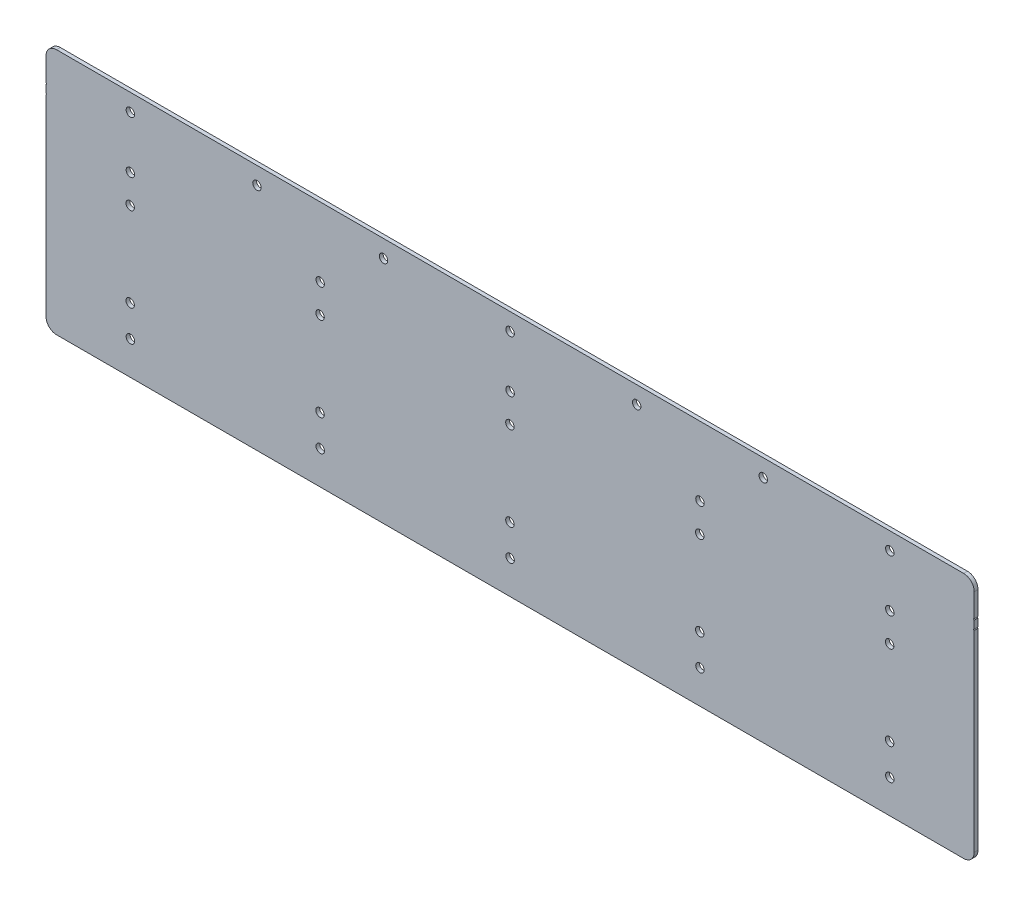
ISO-10303-21;
HEADER;
FILE_DESCRIPTION(('STEP AP214'),'2;1');
FILE_NAME('part.step','',(''),(''),'','','');
FILE_SCHEMA(('AUTOMOTIVE_DESIGN { 1 0 10303 214 1 1 1 1 }'));
ENDSEC;
DATA;
#1=APPLICATION_CONTEXT('core data for automotive mechanical design processes');
#2=APPLICATION_PROTOCOL_DEFINITION('international standard','automotive_design',2000,#1);
#3=PRODUCT_CONTEXT('',#1,'mechanical');
#4=PRODUCT('Part','Part','',(#3));
#5=PRODUCT_RELATED_PRODUCT_CATEGORY('part','',(#4));
#6=PRODUCT_DEFINITION_FORMATION('','',#4);
#7=PRODUCT_DEFINITION_CONTEXT('part definition',#1,'design');
#8=PRODUCT_DEFINITION('design','',#6,#7);
#9=PRODUCT_DEFINITION_SHAPE('','',#8);
#10=(LENGTH_UNIT() NAMED_UNIT(*) SI_UNIT(.MILLI.,.METRE.));
#11=(NAMED_UNIT(*) PLANE_ANGLE_UNIT() SI_UNIT($,.RADIAN.));
#12=(NAMED_UNIT(*) SI_UNIT($,.STERADIAN.) SOLID_ANGLE_UNIT());
#13=UNCERTAINTY_MEASURE_WITH_UNIT(LENGTH_MEASURE(1.E-05),#10,'distance_accuracy_value','');
#14=(GEOMETRIC_REPRESENTATION_CONTEXT(3) GLOBAL_UNCERTAINTY_ASSIGNED_CONTEXT((#13)) GLOBAL_UNIT_ASSIGNED_CONTEXT((#10,
#11,#12)) REPRESENTATION_CONTEXT('',''));
#15=CARTESIAN_POINT('',(0.,0.,0.));
#16=DIRECTION('',(0.,0.,1.));
#17=DIRECTION('',(1.,0.,0.));
#18=AXIS2_PLACEMENT_3D('',#15,#16,#17);
#19=CARTESIAN_POINT('',(50.8,138.22826060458,-2.28600000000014));
#20=DIRECTION('',(0.,0.,-1.));
#21=DIRECTION('',(0.,1.,0.));
#22=AXIS2_PLACEMENT_3D('',#19,#20,#21);
#23=CYLINDRICAL_SURFACE('',#22,2.53999999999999);
#24=CARTESIAN_POINT('',(50.8,138.22826060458,0.));
#25=DIRECTION('',(0.,0.,1.));
#26=DIRECTION('',(0.,-1.,0.));
#27=AXIS2_PLACEMENT_3D('',#24,#25,#26);
#28=CIRCLE('',#27,2.53999999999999);
#29=CARTESIAN_POINT('',(50.8,135.68826060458,0.));
#30=VERTEX_POINT('',#29);
#31=EDGE_CURVE('E458',#30,#30,#28,.T.);
#32=ORIENTED_EDGE('',*,*,#31,.T.);
#33=EDGE_LOOP('',(#32));
#34=FACE_BOUND('',#33,.T.);
#35=CARTESIAN_POINT('',(50.8,138.22826060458,-2.28600000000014));
#36=DIRECTION('',(0.,0.,-1.));
#37=DIRECTION('',(0.,1.,0.));
#38=AXIS2_PLACEMENT_3D('',#35,#36,#37);
#39=CIRCLE('',#38,2.53999999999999);
#40=CARTESIAN_POINT('',(50.8,140.76826060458,-2.28600000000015));
#41=VERTEX_POINT('',#40);
#42=EDGE_CURVE('E461',#41,#41,#39,.T.);
#43=ORIENTED_EDGE('',*,*,#42,.T.);
#44=EDGE_LOOP('',(#43));
#45=FACE_BOUND('',#44,.T.);
#46=ADVANCED_FACE('F87',(#34,#45),#23,.F.);
#47=CARTESIAN_POINT('',(127.,138.22826060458,-2.28600000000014));
#48=DIRECTION('',(0.,0.,-1.));
#49=DIRECTION('',(0.,1.,0.));
#50=AXIS2_PLACEMENT_3D('',#47,#48,#49);
#51=CYLINDRICAL_SURFACE('',#50,2.53999999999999);
#52=CARTESIAN_POINT('',(127.,138.22826060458,0.));
#53=DIRECTION('',(0.,0.,1.));
#54=DIRECTION('',(0.,-1.,0.));
#55=AXIS2_PLACEMENT_3D('',#52,#53,#54);
#56=CIRCLE('',#55,2.53999999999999);
#57=CARTESIAN_POINT('',(127.,135.68826060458,0.));
#58=VERTEX_POINT('',#57);
#59=EDGE_CURVE('E452',#58,#58,#56,.T.);
#60=ORIENTED_EDGE('',*,*,#59,.T.);
#61=EDGE_LOOP('',(#60));
#62=FACE_BOUND('',#61,.T.);
#63=CARTESIAN_POINT('',(127.,138.22826060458,-2.28600000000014));
#64=DIRECTION('',(0.,0.,-1.));
#65=DIRECTION('',(0.,1.,0.));
#66=AXIS2_PLACEMENT_3D('',#63,#64,#65);
#67=CIRCLE('',#66,2.53999999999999);
#68=CARTESIAN_POINT('',(127.,140.76826060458,-2.28600000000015));
#69=VERTEX_POINT('',#68);
#70=EDGE_CURVE('E455',#69,#69,#67,.T.);
#71=ORIENTED_EDGE('',*,*,#70,.T.);
#72=EDGE_LOOP('',(#71));
#73=FACE_BOUND('',#72,.T.);
#74=ADVANCED_FACE('F577',(#62,#73),#51,.F.);
#75=CARTESIAN_POINT('',(203.2,138.22826060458,-2.28600000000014));
#76=DIRECTION('',(0.,0.,-1.));
#77=DIRECTION('',(0.,1.,0.));
#78=AXIS2_PLACEMENT_3D('',#75,#76,#77);
#79=CYLINDRICAL_SURFACE('',#78,2.53999999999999);
#80=CARTESIAN_POINT('',(203.2,138.22826060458,0.));
#81=DIRECTION('',(0.,0.,1.));
#82=DIRECTION('',(0.,-1.,0.));
#83=AXIS2_PLACEMENT_3D('',#80,#81,#82);
#84=CIRCLE('',#83,2.53999999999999);
#85=CARTESIAN_POINT('',(203.2,135.68826060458,0.));
#86=VERTEX_POINT('',#85);
#87=EDGE_CURVE('E446',#86,#86,#84,.T.);
#88=ORIENTED_EDGE('',*,*,#87,.T.);
#89=EDGE_LOOP('',(#88));
#90=FACE_BOUND('',#89,.T.);
#91=CARTESIAN_POINT('',(203.2,138.22826060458,-2.28600000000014));
#92=DIRECTION('',(0.,0.,-1.));
#93=DIRECTION('',(0.,1.,0.));
#94=AXIS2_PLACEMENT_3D('',#91,#92,#93);
#95=CIRCLE('',#94,2.53999999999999);
#96=CARTESIAN_POINT('',(203.2,140.76826060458,-2.28600000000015));
#97=VERTEX_POINT('',#96);
#98=EDGE_CURVE('E449',#97,#97,#95,.T.);
#99=ORIENTED_EDGE('',*,*,#98,.T.);
#100=EDGE_LOOP('',(#99));
#101=FACE_BOUND('',#100,.T.);
#102=ADVANCED_FACE('F583',(#90,#101),#79,.F.);
#103=CARTESIAN_POINT('',(279.4,138.22826060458,-2.28600000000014));
#104=DIRECTION('',(0.,0.,-1.));
#105=DIRECTION('',(0.,1.,0.));
#106=AXIS2_PLACEMENT_3D('',#103,#104,#105);
#107=CYLINDRICAL_SURFACE('',#106,2.53999999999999);
#108=CARTESIAN_POINT('',(279.4,138.22826060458,0.));
#109=DIRECTION('',(0.,0.,1.));
#110=DIRECTION('',(0.,-1.,0.));
#111=AXIS2_PLACEMENT_3D('',#108,#109,#110);
#112=CIRCLE('',#111,2.53999999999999);
#113=CARTESIAN_POINT('',(279.4,135.68826060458,0.));
#114=VERTEX_POINT('',#113);
#115=EDGE_CURVE('E440',#114,#114,#112,.T.);
#116=ORIENTED_EDGE('',*,*,#115,.T.);
#117=EDGE_LOOP('',(#116));
#118=FACE_BOUND('',#117,.T.);
#119=CARTESIAN_POINT('',(279.4,138.22826060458,-2.28600000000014));
#120=DIRECTION('',(0.,0.,-1.));
#121=DIRECTION('',(0.,1.,0.));
#122=AXIS2_PLACEMENT_3D('',#119,#120,#121);
#123=CIRCLE('',#122,2.53999999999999);
#124=CARTESIAN_POINT('',(279.4,140.76826060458,-2.28600000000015));
#125=VERTEX_POINT('',#124);
#126=EDGE_CURVE('E443',#125,#125,#123,.T.);
#127=ORIENTED_EDGE('',*,*,#126,.T.);
#128=EDGE_LOOP('',(#127));
#129=FACE_BOUND('',#128,.T.);
#130=ADVANCED_FACE('F628',(#118,#129),#107,.F.);
#131=CARTESIAN_POINT('',(355.6,138.22826060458,-2.28600000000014));
#132=DIRECTION('',(0.,0.,-1.));
#133=DIRECTION('',(0.,1.,0.));
#134=AXIS2_PLACEMENT_3D('',#131,#132,#133);
#135=CYLINDRICAL_SURFACE('',#134,2.53999999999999);
#136=CARTESIAN_POINT('',(355.6,138.22826060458,0.));
#137=DIRECTION('',(0.,0.,1.));
#138=DIRECTION('',(0.,-1.,0.));
#139=AXIS2_PLACEMENT_3D('',#136,#137,#138);
#140=CIRCLE('',#139,2.53999999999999);
#141=CARTESIAN_POINT('',(355.6,135.68826060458,0.));
#142=VERTEX_POINT('',#141);
#143=EDGE_CURVE('E424',#142,#142,#140,.T.);
#144=ORIENTED_EDGE('',*,*,#143,.T.);
#145=EDGE_LOOP('',(#144));
#146=FACE_BOUND('',#145,.T.);
#147=CARTESIAN_POINT('',(355.6,138.22826060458,-2.28600000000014));
#148=DIRECTION('',(0.,0.,-1.));
#149=DIRECTION('',(0.,1.,0.));
#150=AXIS2_PLACEMENT_3D('',#147,#148,#149);
#151=CIRCLE('',#150,2.53999999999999);
#152=CARTESIAN_POINT('',(355.6,140.76826060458,-2.28600000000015));
#153=VERTEX_POINT('',#152);
#154=EDGE_CURVE('E437',#153,#153,#151,.T.);
#155=ORIENTED_EDGE('',*,*,#154,.T.);
#156=EDGE_LOOP('',(#155));
#157=FACE_BOUND('',#156,.T.);
#158=ADVANCED_FACE('F625',(#146,#157),#135,.F.);
#159=CARTESIAN_POINT('',(0.,148.64226060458,-2.28600000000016));
#160=DIRECTION('',(1.,0.,0.));
#161=DIRECTION('',(0.,-1.,0.));
#162=AXIS2_PLACEMENT_3D('',#159,#160,#161);
#163=PLANE('',#162);
#164=DIRECTION('',(0.,1.,0.));
#165=VECTOR('',#164,1.);
#166=CARTESIAN_POINT('',(0.,125.528260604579,-2.286));
#167=LINE('',#166,#165);
#168=CARTESIAN_POINT('',(0.,128.19526060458,-2.28600000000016));
#169=VERTEX_POINT('',#168);
#170=CARTESIAN_POINT('',(0.,142.29226060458,-2.28600000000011));
#171=VERTEX_POINT('',#170);
#172=EDGE_CURVE('E111',#169,#171,#167,.T.);
#173=ORIENTED_EDGE('',*,*,#172,.F.);
#174=DIRECTION('',(0.,0.,1.));
#175=VECTOR('',#174,1.);
#176=CARTESIAN_POINT('',(0.,128.19526060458,0.));
#177=LINE('',#176,#175);
#178=CARTESIAN_POINT('',(0.,128.19526060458,0.));
#179=VERTEX_POINT('',#178);
#180=EDGE_CURVE('E400',#169,#179,#177,.T.);
#181=ORIENTED_EDGE('',*,*,#180,.T.);
#182=DIRECTION('',(0.,-1.,0.));
#183=VECTOR('',#182,1.);
#184=CARTESIAN_POINT('',(0.,148.64226060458,-1.80411241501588E-13));
#185=LINE('',#184,#183);
#186=CARTESIAN_POINT('',(0.,142.29226060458,-1.11022302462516E-13));
#187=VERTEX_POINT('',#186);
#188=EDGE_CURVE('E421',#179,#187,#185,.F.);
#189=ORIENTED_EDGE('',*,*,#188,.T.);
#190=DIRECTION('',(0.,0.,1.));
#191=VECTOR('',#190,1.);
#192=CARTESIAN_POINT('',(0.,142.29226060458,-2.28600000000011));
#193=LINE('',#192,#191);
#194=EDGE_CURVE('E474',#187,#171,#193,.F.);
#195=ORIENTED_EDGE('',*,*,#194,.T.);
#196=EDGE_LOOP('',(#173,#181,#189,#195));
#197=FACE_BOUND('',#196,.T.);
#198=ADVANCED_FACE('F511',(#197),#163,.F.);
#199=CARTESIAN_POINT('',(558.8,125.52826060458,-2.286));
#200=DIRECTION('',(-1.,0.,0.));
#201=DIRECTION('',(0.,1.,0.));
#202=AXIS2_PLACEMENT_3D('',#199,#200,#201);
#203=PLANE('',#202);
#204=DIRECTION('',(0.,1.,0.));
#205=VECTOR('',#204,1.);
#206=CARTESIAN_POINT('',(558.8,125.52826060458,0.));
#207=LINE('',#206,#205);
#208=CARTESIAN_POINT('',(558.8,142.29226060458,-1.11022302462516E-13));
#209=VERTEX_POINT('',#208);
#210=CARTESIAN_POINT('',(558.8,128.19526060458,0.));
#211=VERTEX_POINT('',#210);
#212=EDGE_CURVE('E428',#209,#211,#207,.F.);
#213=ORIENTED_EDGE('',*,*,#212,.T.);
#214=DIRECTION('',(0.,0.,1.));
#215=VECTOR('',#214,1.);
#216=CARTESIAN_POINT('',(558.8,128.19526060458,0.));
#217=LINE('',#216,#215);
#218=CARTESIAN_POINT('',(558.8,128.19526060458,-2.28600000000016));
#219=VERTEX_POINT('',#218);
#220=EDGE_CURVE('E405',#211,#219,#217,.F.);
#221=ORIENTED_EDGE('',*,*,#220,.T.);
#222=DIRECTION('',(0.,-1.,0.));
#223=VECTOR('',#222,1.);
#224=CARTESIAN_POINT('',(558.8,125.528260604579,-2.286));
#225=LINE('',#224,#223);
#226=CARTESIAN_POINT('',(558.8,142.29226060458,-2.28600000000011));
#227=VERTEX_POINT('',#226);
#228=EDGE_CURVE('E422',#227,#219,#225,.T.);
#229=ORIENTED_EDGE('',*,*,#228,.F.);
#230=DIRECTION('',(0.,0.,1.));
#231=VECTOR('',#230,1.);
#232=CARTESIAN_POINT('',(558.8,142.29226060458,-2.28600000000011));
#233=LINE('',#232,#231);
#234=EDGE_CURVE('E13',#227,#209,#233,.T.);
#235=ORIENTED_EDGE('',*,*,#234,.T.);
#236=EDGE_LOOP('',(#213,#221,#229,#235));
#237=FACE_BOUND('',#236,.T.);
#238=ADVANCED_FACE('F528',(#237),#203,.F.);
#239=CARTESIAN_POINT('',(0.,125.528260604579,-2.286));
#240=DIRECTION('',(0.,0.,1.));
#241=DIRECTION('',(0.,-1.,0.));
#242=AXIS2_PLACEMENT_3D('',#239,#240,#241);
#243=PLANE('',#242);
#244=CARTESIAN_POINT('',(431.8,138.22826060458,-2.28600000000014));
#245=DIRECTION('',(0.,0.,-1.));
#246=DIRECTION('',(0.,1.,0.));
#247=AXIS2_PLACEMENT_3D('',#244,#245,#246);
#248=CIRCLE('',#247,2.53999999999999);
#249=CARTESIAN_POINT('',(431.8,140.76826060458,-2.28600000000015));
#250=VERTEX_POINT('',#249);
#251=EDGE_CURVE('E412',#250,#250,#248,.T.);
#252=ORIENTED_EDGE('',*,*,#251,.F.);
#253=EDGE_LOOP('',(#252));
#254=FACE_BOUND('',#253,.T.);
#255=CARTESIAN_POINT('',(508.,138.22826060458,-2.28600000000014));
#256=DIRECTION('',(0.,0.,-1.));
#257=DIRECTION('',(0.,1.,0.));
#258=AXIS2_PLACEMENT_3D('',#255,#256,#257);
#259=CIRCLE('',#258,2.53999999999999);
#260=CARTESIAN_POINT('',(508.,140.76826060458,-2.28600000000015));
#261=VERTEX_POINT('',#260);
#262=EDGE_CURVE('E415',#261,#261,#259,.T.);
#263=ORIENTED_EDGE('',*,*,#262,.F.);
#264=EDGE_LOOP('',(#263));
#265=FACE_BOUND('',#264,.T.);
#266=CARTESIAN_POINT('',(558.8,127.81426060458,-2.28600000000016));
#267=DIRECTION('',(0.,0.,1.));
#268=DIRECTION('',(1.,0.,0.));
#269=AXIS2_PLACEMENT_3D('',#266,#267,#268);
#270=CIRCLE('',#269,0.380999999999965);
#271=CARTESIAN_POINT('',(558.8,127.43326060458,-2.28599999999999));
#272=VERTEX_POINT('',#271);
#273=EDGE_CURVE('E409',#219,#272,#270,.T.);
#274=ORIENTED_EDGE('',*,*,#273,.T.);
#275=DIRECTION('',(0.,1.,0.));
#276=VECTOR('',#275,1.);
#277=CARTESIAN_POINT('',(558.8,125.12113030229,-2.28599999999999));
#278=LINE('',#277,#276);
#279=CARTESIAN_POINT('',(558.8,122.809,-2.28599999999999));
#280=VERTEX_POINT('',#279);
#281=EDGE_CURVE('E377',#272,#280,#278,.F.);
#282=ORIENTED_EDGE('',*,*,#281,.T.);
#283=CARTESIAN_POINT('',(558.8,122.428,-2.28599999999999));
#284=DIRECTION('',(0.,0.,1.));
#285=DIRECTION('',(1.,0.,0.));
#286=AXIS2_PLACEMENT_3D('',#283,#284,#285);
#287=CIRCLE('',#286,0.380999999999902);
#288=CARTESIAN_POINT('',(558.8,122.047,-2.28600000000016));
#289=VERTEX_POINT('',#288);
#290=EDGE_CURVE('E380',#280,#289,#287,.T.);
#291=ORIENTED_EDGE('',*,*,#290,.T.);
#292=DIRECTION('',(0.,1.,0.));
#293=VECTOR('',#292,1.);
#294=CARTESIAN_POINT('',(558.8,0.,-2.286));
#295=LINE('',#294,#293);
#296=CARTESIAN_POINT('',(558.8,6.35,-2.286));
#297=VERTEX_POINT('',#296);
#298=EDGE_CURVE('E328',#297,#289,#295,.T.);
#299=ORIENTED_EDGE('',*,*,#298,.F.);
#300=CARTESIAN_POINT('',(552.45,6.35,-2.286));
#301=DIRECTION('',(0.,0.,-1.));
#302=DIRECTION('',(-1.,0.,0.));
#303=AXIS2_PLACEMENT_3D('',#300,#301,#302);
#304=CIRCLE('',#303,6.35);
#305=CARTESIAN_POINT('',(552.45,0.,-2.286));
#306=VERTEX_POINT('',#305);
#307=EDGE_CURVE('E239',#297,#306,#304,.T.);
#308=ORIENTED_EDGE('',*,*,#307,.T.);
#309=DIRECTION('',(1.,0.,0.));
#310=VECTOR('',#309,1.);
#311=CARTESIAN_POINT('',(0.,0.,-2.286));
#312=LINE('',#311,#310);
#313=CARTESIAN_POINT('',(6.35,0.,-2.286));
#314=VERTEX_POINT('',#313);
#315=EDGE_CURVE('E336',#314,#306,#312,.T.);
#316=ORIENTED_EDGE('',*,*,#315,.F.);
#317=CARTESIAN_POINT('',(6.35,6.35,-2.286));
#318=DIRECTION('',(0.,0.,-1.));
#319=DIRECTION('',(-1.,0.,0.));
#320=AXIS2_PLACEMENT_3D('',#317,#318,#319);
#321=CIRCLE('',#320,6.35);
#322=CARTESIAN_POINT('',(0.,6.35,-2.286));
#323=VERTEX_POINT('',#322);
#324=EDGE_CURVE('E233',#314,#323,#321,.T.);
#325=ORIENTED_EDGE('',*,*,#324,.T.);
#326=DIRECTION('',(0.,-1.,0.));
#327=VECTOR('',#326,1.);
#328=CARTESIAN_POINT('',(0.,0.,-2.286));
#329=LINE('',#328,#327);
#330=CARTESIAN_POINT('',(0.,122.047,-2.28600000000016));
#331=VERTEX_POINT('',#330);
#332=EDGE_CURVE('E326',#331,#323,#329,.T.);
#333=ORIENTED_EDGE('',*,*,#332,.F.);
#334=CARTESIAN_POINT('',(0.,122.428,-2.28599999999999));
#335=DIRECTION('',(0.,0.,1.));
#336=DIRECTION('',(1.,0.,0.));
#337=AXIS2_PLACEMENT_3D('',#334,#335,#336);
#338=CIRCLE('',#337,0.380999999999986);
#339=CARTESIAN_POINT('',(0.,122.809,-2.28599999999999));
#340=VERTEX_POINT('',#339);
#341=EDGE_CURVE('E218',#331,#340,#338,.T.);
#342=ORIENTED_EDGE('',*,*,#341,.T.);
#343=DIRECTION('',(0.,1.,0.));
#344=VECTOR('',#343,1.);
#345=CARTESIAN_POINT('',(0.,125.12113030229,-2.28599999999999));
#346=LINE('',#345,#344);
#347=CARTESIAN_POINT('',(0.,127.43326060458,-2.28599999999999));
#348=VERTEX_POINT('',#347);
#349=EDGE_CURVE('E381',#340,#348,#346,.T.);
#350=ORIENTED_EDGE('',*,*,#349,.T.);
#351=CARTESIAN_POINT('',(0.,127.81426060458,-2.28600000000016));
#352=DIRECTION('',(0.,0.,1.));
#353=DIRECTION('',(1.,0.,0.));
#354=AXIS2_PLACEMENT_3D('',#351,#352,#353);
#355=CIRCLE('',#354,0.381000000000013);
#356=EDGE_CURVE('E404',#348,#169,#355,.T.);
#357=ORIENTED_EDGE('',*,*,#356,.T.);
#358=ORIENTED_EDGE('',*,*,#172,.T.);
#359=CARTESIAN_POINT('',(6.34999999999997,142.29226060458,-2.28600000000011));
#360=DIRECTION('',(0.,0.,1.));
#361=DIRECTION('',(0.,-1.,0.));
#362=AXIS2_PLACEMENT_3D('',#359,#360,#361);
#363=CIRCLE('',#362,6.35);
#364=CARTESIAN_POINT('',(6.34999999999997,148.64226060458,-2.28600000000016));
#365=VERTEX_POINT('',#364);
#366=EDGE_CURVE('E96',#171,#365,#363,.F.);
#367=ORIENTED_EDGE('',*,*,#366,.T.);
#368=DIRECTION('',(1.,0.,0.));
#369=VECTOR('',#368,1.);
#370=CARTESIAN_POINT('',(0.,148.64226060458,-2.28600000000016));
#371=LINE('',#370,#369);
#372=CARTESIAN_POINT('',(552.45,148.64226060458,-2.28600000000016));
#373=VERTEX_POINT('',#372);
#374=EDGE_CURVE('E425',#365,#373,#371,.T.);
#375=ORIENTED_EDGE('',*,*,#374,.T.);
#376=CARTESIAN_POINT('',(552.45,142.29226060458,-2.28600000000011));
#377=DIRECTION('',(0.,0.,1.));
#378=DIRECTION('',(0.,-1.,0.));
#379=AXIS2_PLACEMENT_3D('',#376,#377,#378);
#380=CIRCLE('',#379,6.35);
#381=EDGE_CURVE('E104',#373,#227,#380,.F.);
#382=ORIENTED_EDGE('',*,*,#381,.T.);
#383=ORIENTED_EDGE('',*,*,#228,.T.);
#384=EDGE_LOOP('',(#274,#282,#291,#299,#308,#316,#325,#333,#342,#350,#357,#358,#367,#375,#382,#383));
#385=FACE_BOUND('',#384,.T.);
#386=ORIENTED_EDGE('',*,*,#154,.F.);
#387=EDGE_LOOP('',(#386));
#388=FACE_BOUND('',#387,.T.);
#389=ORIENTED_EDGE('',*,*,#126,.F.);
#390=EDGE_LOOP('',(#389));
#391=FACE_BOUND('',#390,.T.);
#392=ORIENTED_EDGE('',*,*,#98,.F.);
#393=EDGE_LOOP('',(#392));
#394=FACE_BOUND('',#393,.T.);
#395=ORIENTED_EDGE('',*,*,#70,.F.);
#396=EDGE_LOOP('',(#395));
#397=FACE_BOUND('',#396,.T.);
#398=ORIENTED_EDGE('',*,*,#42,.F.);
#399=EDGE_LOOP('',(#398));
#400=FACE_BOUND('',#399,.T.);
#401=CARTESIAN_POINT('',(393.584187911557,38.7985,-2.286));
#402=DIRECTION('',(0.,0.,-1.));
#403=DIRECTION('',(-1.,0.,0.));
#404=AXIS2_PLACEMENT_3D('',#401,#402,#403);
#405=CIRCLE('',#404,2.53999999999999);
#406=CARTESIAN_POINT('',(391.044187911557,38.7985,-2.286));
#407=VERTEX_POINT('',#406);
#408=EDGE_CURVE('E268',#407,#407,#405,.T.);
#409=ORIENTED_EDGE('',*,*,#408,.F.);
#410=EDGE_LOOP('',(#409));
#411=FACE_BOUND('',#410,.T.);
#412=CARTESIAN_POINT('',(393.584187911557,89.5985,-2.286));
#413=DIRECTION('',(0.,0.,-1.));
#414=DIRECTION('',(-1.,0.,0.));
#415=AXIS2_PLACEMENT_3D('',#412,#413,#414);
#416=CIRCLE('',#415,2.53999999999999);
#417=CARTESIAN_POINT('',(391.044187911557,89.5985,-2.286));
#418=VERTEX_POINT('',#417);
#419=EDGE_CURVE('E274',#418,#418,#416,.T.);
#420=ORIENTED_EDGE('',*,*,#419,.F.);
#421=EDGE_LOOP('',(#420));
#422=FACE_BOUND('',#421,.T.);
#423=CARTESIAN_POINT('',(507.884187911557,89.5985,-2.286));
#424=DIRECTION('',(0.,0.,-1.));
#425=DIRECTION('',(-1.,0.,0.));
#426=AXIS2_PLACEMENT_3D('',#423,#424,#425);
#427=CIRCLE('',#426,2.53999999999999);
#428=CARTESIAN_POINT('',(505.344187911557,89.5985,-2.286));
#429=VERTEX_POINT('',#428);
#430=EDGE_CURVE('E280',#429,#429,#427,.T.);
#431=ORIENTED_EDGE('',*,*,#430,.F.);
#432=EDGE_LOOP('',(#431));
#433=FACE_BOUND('',#432,.T.);
#434=CARTESIAN_POINT('',(507.884187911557,38.7985,-2.286));
#435=DIRECTION('',(0.,0.,-1.));
#436=DIRECTION('',(-1.,0.,0.));
#437=AXIS2_PLACEMENT_3D('',#434,#435,#436);
#438=CIRCLE('',#437,2.53999999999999);
#439=CARTESIAN_POINT('',(505.344187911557,38.7985,-2.286));
#440=VERTEX_POINT('',#439);
#441=EDGE_CURVE('E286',#440,#440,#438,.T.);
#442=ORIENTED_EDGE('',*,*,#441,.F.);
#443=EDGE_LOOP('',(#442));
#444=FACE_BOUND('',#443,.T.);
#445=CARTESIAN_POINT('',(50.8,20.066,-2.286));
#446=DIRECTION('',(0.,0.,-1.));
#447=DIRECTION('',(-1.,0.,0.));
#448=AXIS2_PLACEMENT_3D('',#445,#446,#447);
#449=CIRCLE('',#448,2.54000000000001);
#450=CARTESIAN_POINT('',(48.26,20.066,-2.286));
#451=VERTEX_POINT('',#450);
#452=EDGE_CURVE('E292',#451,#451,#449,.T.);
#453=ORIENTED_EDGE('',*,*,#452,.F.);
#454=EDGE_LOOP('',(#453));
#455=FACE_BOUND('',#454,.T.);
#456=CARTESIAN_POINT('',(50.8,106.934,-2.286));
#457=DIRECTION('',(0.,0.,-1.));
#458=DIRECTION('',(-1.,0.,0.));
#459=AXIS2_PLACEMENT_3D('',#456,#457,#458);
#460=CIRCLE('',#459,2.54000000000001);
#461=CARTESIAN_POINT('',(48.26,106.934,-2.286));
#462=VERTEX_POINT('',#461);
#463=EDGE_CURVE('E298',#462,#462,#460,.T.);
#464=ORIENTED_EDGE('',*,*,#463,.F.);
#465=EDGE_LOOP('',(#464));
#466=FACE_BOUND('',#465,.T.);
#467=CARTESIAN_POINT('',(165.1,20.066,-2.286));
#468=DIRECTION('',(0.,0.,1.));
#469=DIRECTION('',(1.,0.,0.));
#470=AXIS2_PLACEMENT_3D('',#467,#468,#469);
#471=CIRCLE('',#470,2.53999999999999);
#472=CARTESIAN_POINT('',(167.64,20.066,-2.286));
#473=VERTEX_POINT('',#472);
#474=EDGE_CURVE('E262',#473,#473,#471,.T.);
#475=ORIENTED_EDGE('',*,*,#474,.T.);
#476=EDGE_LOOP('',(#475));
#477=FACE_BOUND('',#476,.T.);
#478=CARTESIAN_POINT('',(279.4,106.934,-2.286));
#479=DIRECTION('',(0.,0.,1.));
#480=DIRECTION('',(1.,0.,0.));
#481=AXIS2_PLACEMENT_3D('',#478,#479,#480);
#482=CIRCLE('',#481,2.53999999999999);
#483=CARTESIAN_POINT('',(281.94,106.934,-2.286));
#484=VERTEX_POINT('',#483);
#485=EDGE_CURVE('E259',#484,#484,#482,.T.);
#486=ORIENTED_EDGE('',*,*,#485,.T.);
#487=EDGE_LOOP('',(#486));
#488=FACE_BOUND('',#487,.T.);
#489=CARTESIAN_POINT('',(279.4,20.066,-2.286));
#490=DIRECTION('',(0.,0.,1.));
#491=DIRECTION('',(1.,0.,0.));
#492=AXIS2_PLACEMENT_3D('',#489,#490,#491);
#493=CIRCLE('',#492,2.53999999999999);
#494=CARTESIAN_POINT('',(281.94,20.066,-2.286));
#495=VERTEX_POINT('',#494);
#496=EDGE_CURVE('E256',#495,#495,#493,.T.);
#497=ORIENTED_EDGE('',*,*,#496,.T.);
#498=EDGE_LOOP('',(#497));
#499=FACE_BOUND('',#498,.T.);
#500=CARTESIAN_POINT('',(165.1,106.934,-2.286));
#501=DIRECTION('',(0.,0.,1.));
#502=DIRECTION('',(1.,0.,0.));
#503=AXIS2_PLACEMENT_3D('',#500,#501,#502);
#504=CIRCLE('',#503,2.53999999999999);
#505=CARTESIAN_POINT('',(167.64,106.934,-2.286));
#506=VERTEX_POINT('',#505);
#507=EDGE_CURVE('E253',#506,#506,#504,.T.);
#508=ORIENTED_EDGE('',*,*,#507,.T.);
#509=EDGE_LOOP('',(#508));
#510=FACE_BOUND('',#509,.T.);
#511=CARTESIAN_POINT('',(393.7,106.934,-2.286));
#512=DIRECTION('',(0.,0.,1.));
#513=DIRECTION('',(1.,0.,0.));
#514=AXIS2_PLACEMENT_3D('',#511,#512,#513);
#515=CIRCLE('',#514,2.53999999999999);
#516=CARTESIAN_POINT('',(396.24,106.934,-2.286));
#517=VERTEX_POINT('',#516);
#518=EDGE_CURVE('E250',#517,#517,#515,.T.);
#519=ORIENTED_EDGE('',*,*,#518,.T.);
#520=EDGE_LOOP('',(#519));
#521=FACE_BOUND('',#520,.T.);
#522=CARTESIAN_POINT('',(393.7,20.066,-2.286));
#523=DIRECTION('',(0.,0.,1.));
#524=DIRECTION('',(1.,0.,0.));
#525=AXIS2_PLACEMENT_3D('',#522,#523,#524);
#526=CIRCLE('',#525,2.53999999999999);
#527=CARTESIAN_POINT('',(396.24,20.066,-2.286));
#528=VERTEX_POINT('',#527);
#529=EDGE_CURVE('E247',#528,#528,#526,.T.);
#530=ORIENTED_EDGE('',*,*,#529,.T.);
#531=EDGE_LOOP('',(#530));
#532=FACE_BOUND('',#531,.T.);
#533=CARTESIAN_POINT('',(508.,106.934,-2.286));
#534=DIRECTION('',(0.,0.,1.));
#535=DIRECTION('',(1.,0.,0.));
#536=AXIS2_PLACEMENT_3D('',#533,#534,#535);
#537=CIRCLE('',#536,2.53999999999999);
#538=CARTESIAN_POINT('',(510.54,106.934,-2.286));
#539=VERTEX_POINT('',#538);
#540=EDGE_CURVE('E244',#539,#539,#537,.T.);
#541=ORIENTED_EDGE('',*,*,#540,.T.);
#542=EDGE_LOOP('',(#541));
#543=FACE_BOUND('',#542,.T.);
#544=CARTESIAN_POINT('',(508.,20.066,-2.286));
#545=DIRECTION('',(0.,0.,1.));
#546=DIRECTION('',(1.,0.,0.));
#547=AXIS2_PLACEMENT_3D('',#544,#545,#546);
#548=CIRCLE('',#547,2.53999999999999);
#549=CARTESIAN_POINT('',(510.54,20.066,-2.286));
#550=VERTEX_POINT('',#549);
#551=EDGE_CURVE('E241',#550,#550,#548,.T.);
#552=ORIENTED_EDGE('',*,*,#551,.T.);
#553=EDGE_LOOP('',(#552));
#554=FACE_BOUND('',#553,.T.);
#555=CARTESIAN_POINT('',(279.284187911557,89.5985,-2.286));
#556=DIRECTION('',(0.,0.,-1.));
#557=DIRECTION('',(-1.,0.,0.));
#558=AXIS2_PLACEMENT_3D('',#555,#556,#557);
#559=CIRCLE('',#558,2.53999999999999);
#560=CARTESIAN_POINT('',(276.744187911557,89.5985,-2.286));
#561=VERTEX_POINT('',#560);
#562=EDGE_CURVE('E344',#561,#561,#559,.T.);
#563=ORIENTED_EDGE('',*,*,#562,.F.);
#564=EDGE_LOOP('',(#563));
#565=FACE_BOUND('',#564,.T.);
#566=CARTESIAN_POINT('',(164.984187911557,89.5985,-2.286));
#567=DIRECTION('',(0.,0.,-1.));
#568=DIRECTION('',(-1.,0.,0.));
#569=AXIS2_PLACEMENT_3D('',#566,#567,#568);
#570=CIRCLE('',#569,2.53999999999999);
#571=CARTESIAN_POINT('',(162.444187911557,89.5985,-2.286));
#572=VERTEX_POINT('',#571);
#573=EDGE_CURVE('E350',#572,#572,#570,.T.);
#574=ORIENTED_EDGE('',*,*,#573,.F.);
#575=EDGE_LOOP('',(#574));
#576=FACE_BOUND('',#575,.T.);
#577=CARTESIAN_POINT('',(50.6841879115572,89.5985,-2.286));
#578=DIRECTION('',(0.,0.,-1.));
#579=DIRECTION('',(-1.,0.,0.));
#580=AXIS2_PLACEMENT_3D('',#577,#578,#579);
#581=CIRCLE('',#580,2.53999999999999);
#582=CARTESIAN_POINT('',(48.1441879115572,89.5985,-2.286));
#583=VERTEX_POINT('',#582);
#584=EDGE_CURVE('E356',#583,#583,#581,.T.);
#585=ORIENTED_EDGE('',*,*,#584,.F.);
#586=EDGE_LOOP('',(#585));
#587=FACE_BOUND('',#586,.T.);
#588=CARTESIAN_POINT('',(279.284187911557,38.7985,-2.286));
#589=DIRECTION('',(0.,0.,-1.));
#590=DIRECTION('',(-1.,0.,0.));
#591=AXIS2_PLACEMENT_3D('',#588,#589,#590);
#592=CIRCLE('',#591,2.53999999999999);
#593=CARTESIAN_POINT('',(276.744187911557,38.7985,-2.286));
#594=VERTEX_POINT('',#593);
#595=EDGE_CURVE('E362',#594,#594,#592,.T.);
#596=ORIENTED_EDGE('',*,*,#595,.F.);
#597=EDGE_LOOP('',(#596));
#598=FACE_BOUND('',#597,.T.);
#599=CARTESIAN_POINT('',(164.984187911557,38.7985,-2.286));
#600=DIRECTION('',(0.,0.,-1.));
#601=DIRECTION('',(-1.,0.,0.));
#602=AXIS2_PLACEMENT_3D('',#599,#600,#601);
#603=CIRCLE('',#602,2.53999999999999);
#604=CARTESIAN_POINT('',(162.444187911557,38.7985,-2.286));
#605=VERTEX_POINT('',#604);
#606=EDGE_CURVE('E368',#605,#605,#603,.T.);
#607=ORIENTED_EDGE('',*,*,#606,.F.);
#608=EDGE_LOOP('',(#607));
#609=FACE_BOUND('',#608,.T.);
#610=CARTESIAN_POINT('',(50.6841879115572,38.7985,-2.286));
#611=DIRECTION('',(0.,0.,-1.));
#612=DIRECTION('',(-1.,0.,0.));
#613=AXIS2_PLACEMENT_3D('',#610,#611,#612);
#614=CIRCLE('',#613,2.53999999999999);
#615=CARTESIAN_POINT('',(48.1441879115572,38.7985,-2.286));
#616=VERTEX_POINT('',#615);
#617=EDGE_CURVE('E374',#616,#616,#614,.T.);
#618=ORIENTED_EDGE('',*,*,#617,.F.);
#619=EDGE_LOOP('',(#618));
#620=FACE_BOUND('',#619,.T.);
#621=ADVANCED_FACE('F503',(#254,#265,#385,#388,#391,#394,#397,#400,#411,#422,#433,#444,#455,
#466,#477,#488,#499,#510,#521,#532,#543,#554,#565,#576,#587,#598,#609,#620),#243,.F.);
#622=CARTESIAN_POINT('',(0.,0.,0.));
#623=DIRECTION('',(0.,0.,-1.));
#624=DIRECTION('',(-1.,0.,0.));
#625=AXIS2_PLACEMENT_3D('',#622,#623,#624);
#626=PLANE('',#625);
#627=CARTESIAN_POINT('',(0.,127.81426060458,0.));
#628=DIRECTION('',(0.,0.,1.));
#629=DIRECTION('',(1.,0.,0.));
#630=AXIS2_PLACEMENT_3D('',#627,#628,#629);
#631=CIRCLE('',#630,0.381000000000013);
#632=CARTESIAN_POINT('',(0.,127.43326060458,0.));
#633=VERTEX_POINT('',#632);
#634=EDGE_CURVE('E398',#633,#179,#631,.T.);
#635=ORIENTED_EDGE('',*,*,#634,.F.);
#636=DIRECTION('',(0.,1.,0.));
#637=VECTOR('',#636,1.);
#638=CARTESIAN_POINT('',(0.,125.12113030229,0.));
#639=LINE('',#638,#637);
#640=CARTESIAN_POINT('',(0.,122.809,0.));
#641=VERTEX_POINT('',#640);
#642=EDGE_CURVE('E211',#641,#633,#639,.T.);
#643=ORIENTED_EDGE('',*,*,#642,.F.);
#644=CARTESIAN_POINT('',(0.,122.428,0.));
#645=DIRECTION('',(0.,0.,1.));
#646=DIRECTION('',(1.,0.,0.));
#647=AXIS2_PLACEMENT_3D('',#644,#645,#646);
#648=CIRCLE('',#647,0.380999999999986);
#649=CARTESIAN_POINT('',(0.,122.047,0.));
#650=VERTEX_POINT('',#649);
#651=EDGE_CURVE('E204',#650,#641,#648,.T.);
#652=ORIENTED_EDGE('',*,*,#651,.F.);
#653=DIRECTION('',(0.,-1.,0.));
#654=VECTOR('',#653,1.);
#655=CARTESIAN_POINT('',(0.,0.,0.));
#656=LINE('',#655,#654);
#657=CARTESIAN_POINT('',(0.,6.35,0.));
#658=VERTEX_POINT('',#657);
#659=EDGE_CURVE('E208',#650,#658,#656,.T.);
#660=ORIENTED_EDGE('',*,*,#659,.T.);
#661=CARTESIAN_POINT('',(6.35,6.35,0.));
#662=DIRECTION('',(0.,0.,-1.));
#663=DIRECTION('',(-1.,0.,0.));
#664=AXIS2_PLACEMENT_3D('',#661,#662,#663);
#665=CIRCLE('',#664,6.35);
#666=CARTESIAN_POINT('',(6.35,0.,0.));
#667=VERTEX_POINT('',#666);
#668=EDGE_CURVE('E227',#658,#667,#665,.F.);
#669=ORIENTED_EDGE('',*,*,#668,.T.);
#670=DIRECTION('',(1.,0.,0.));
#671=VECTOR('',#670,1.);
#672=CARTESIAN_POINT('',(0.,0.,0.));
#673=LINE('',#672,#671);
#674=CARTESIAN_POINT('',(552.45,0.,0.));
#675=VERTEX_POINT('',#674);
#676=EDGE_CURVE('E230',#667,#675,#673,.T.);
#677=ORIENTED_EDGE('',*,*,#676,.T.);
#678=CARTESIAN_POINT('',(552.45,6.35,0.));
#679=DIRECTION('',(0.,0.,-1.));
#680=DIRECTION('',(-1.,0.,0.));
#681=AXIS2_PLACEMENT_3D('',#678,#679,#680);
#682=CIRCLE('',#681,6.35);
#683=CARTESIAN_POINT('',(558.8,6.35,0.));
#684=VERTEX_POINT('',#683);
#685=EDGE_CURVE('E553',#675,#684,#682,.F.);
#686=ORIENTED_EDGE('',*,*,#685,.T.);
#687=DIRECTION('',(0.,1.,0.));
#688=VECTOR('',#687,1.);
#689=CARTESIAN_POINT('',(558.8,0.,0.));
#690=LINE('',#689,#688);
#691=CARTESIAN_POINT('',(558.8,122.047,0.));
#692=VERTEX_POINT('',#691);
#693=EDGE_CURVE('E221',#684,#692,#690,.T.);
#694=ORIENTED_EDGE('',*,*,#693,.T.);
#695=CARTESIAN_POINT('',(558.8,122.428,0.));
#696=DIRECTION('',(0.,0.,1.));
#697=DIRECTION('',(1.,0.,0.));
#698=AXIS2_PLACEMENT_3D('',#695,#696,#697);
#699=CIRCLE('',#698,0.380999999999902);
#700=CARTESIAN_POINT('',(558.8,122.809,0.));
#701=VERTEX_POINT('',#700);
#702=EDGE_CURVE('E387',#701,#692,#699,.T.);
#703=ORIENTED_EDGE('',*,*,#702,.F.);
#704=DIRECTION('',(0.,1.,0.));
#705=VECTOR('',#704,1.);
#706=CARTESIAN_POINT('',(558.8,125.12113030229,0.));
#707=LINE('',#706,#705);
#708=CARTESIAN_POINT('',(558.8,127.43326060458,0.));
#709=VERTEX_POINT('',#708);
#710=EDGE_CURVE('E384',#709,#701,#707,.F.);
#711=ORIENTED_EDGE('',*,*,#710,.F.);
#712=CARTESIAN_POINT('',(558.8,127.81426060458,0.));
#713=DIRECTION('',(0.,0.,1.));
#714=DIRECTION('',(1.,0.,0.));
#715=AXIS2_PLACEMENT_3D('',#712,#713,#714);
#716=CIRCLE('',#715,0.380999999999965);
#717=EDGE_CURVE('E403',#211,#709,#716,.T.);
#718=ORIENTED_EDGE('',*,*,#717,.F.);
#719=ORIENTED_EDGE('',*,*,#212,.F.);
#720=CARTESIAN_POINT('',(552.45,142.29226060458,-1.11022302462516E-13));
#721=DIRECTION('',(0.,0.,1.));
#722=DIRECTION('',(0.,-1.,0.));
#723=AXIS2_PLACEMENT_3D('',#720,#721,#722);
#724=CIRCLE('',#723,6.35);
#725=CARTESIAN_POINT('',(552.45,148.64226060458,-1.80411241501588E-13));
#726=VERTEX_POINT('',#725);
#727=EDGE_CURVE('E469',#209,#726,#724,.T.);
#728=ORIENTED_EDGE('',*,*,#727,.T.);
#729=DIRECTION('',(-1.,0.,0.));
#730=VECTOR('',#729,1.);
#731=CARTESIAN_POINT('',(558.8,148.64226060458,-1.80411241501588E-13));
#732=LINE('',#731,#730);
#733=CARTESIAN_POINT('',(6.34999999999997,148.64226060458,-1.80411241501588E-13));
#734=VERTEX_POINT('',#733);
#735=EDGE_CURVE('E431',#734,#726,#732,.F.);
#736=ORIENTED_EDGE('',*,*,#735,.F.);
#737=CARTESIAN_POINT('',(6.34999999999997,142.29226060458,-1.11022302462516E-13));
#738=DIRECTION('',(0.,0.,1.));
#739=DIRECTION('',(0.,-1.,0.));
#740=AXIS2_PLACEMENT_3D('',#737,#738,#739);
#741=CIRCLE('',#740,6.35);
#742=EDGE_CURVE('E471',#734,#187,#741,.T.);
#743=ORIENTED_EDGE('',*,*,#742,.T.);
#744=ORIENTED_EDGE('',*,*,#188,.F.);
#745=EDGE_LOOP('',(#635,#643,#652,#660,#669,#677,#686,#694,#703,#711,#718,#719,#728,#736,#743,#744));
#746=FACE_BOUND('',#745,.T.);
#747=CARTESIAN_POINT('',(431.8,138.22826060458,0.));
#748=DIRECTION('',(0.,0.,1.));
#749=DIRECTION('',(0.,-1.,0.));
#750=AXIS2_PLACEMENT_3D('',#747,#748,#749);
#751=CIRCLE('',#750,2.53999999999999);
#752=CARTESIAN_POINT('',(431.8,135.68826060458,0.));
#753=VERTEX_POINT('',#752);
#754=EDGE_CURVE('E408',#753,#753,#751,.T.);
#755=ORIENTED_EDGE('',*,*,#754,.F.);
#756=EDGE_LOOP('',(#755));
#757=FACE_BOUND('',#756,.T.);
#758=CARTESIAN_POINT('',(508.,138.22826060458,0.));
#759=DIRECTION('',(0.,0.,1.));
#760=DIRECTION('',(0.,-1.,0.));
#761=AXIS2_PLACEMENT_3D('',#758,#759,#760);
#762=CIRCLE('',#761,2.53999999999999);
#763=CARTESIAN_POINT('',(508.,135.68826060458,0.));
#764=VERTEX_POINT('',#763);
#765=EDGE_CURVE('E418',#764,#764,#762,.T.);
#766=ORIENTED_EDGE('',*,*,#765,.F.);
#767=EDGE_LOOP('',(#766));
#768=FACE_BOUND('',#767,.T.);
#769=ORIENTED_EDGE('',*,*,#143,.F.);
#770=EDGE_LOOP('',(#769));
#771=FACE_BOUND('',#770,.T.);
#772=ORIENTED_EDGE('',*,*,#115,.F.);
#773=EDGE_LOOP('',(#772));
#774=FACE_BOUND('',#773,.T.);
#775=ORIENTED_EDGE('',*,*,#87,.F.);
#776=EDGE_LOOP('',(#775));
#777=FACE_BOUND('',#776,.T.);
#778=ORIENTED_EDGE('',*,*,#59,.F.);
#779=EDGE_LOOP('',(#778));
#780=FACE_BOUND('',#779,.T.);
#781=ORIENTED_EDGE('',*,*,#31,.F.);
#782=EDGE_LOOP('',(#781));
#783=FACE_BOUND('',#782,.T.);
#784=CARTESIAN_POINT('',(393.584187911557,38.7985,0.));
#785=DIRECTION('',(0.,0.,1.));
#786=DIRECTION('',(1.,0.,0.));
#787=AXIS2_PLACEMENT_3D('',#784,#785,#786);
#788=CIRCLE('',#787,2.53999999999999);
#789=CARTESIAN_POINT('',(396.124187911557,38.7985,0.));
#790=VERTEX_POINT('',#789);
#791=EDGE_CURVE('E265',#790,#790,#788,.T.);
#792=ORIENTED_EDGE('',*,*,#791,.F.);
#793=EDGE_LOOP('',(#792));
#794=FACE_BOUND('',#793,.T.);
#795=CARTESIAN_POINT('',(393.584187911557,89.5985,0.));
#796=DIRECTION('',(0.,0.,1.));
#797=DIRECTION('',(1.,0.,0.));
#798=AXIS2_PLACEMENT_3D('',#795,#796,#797);
#799=CIRCLE('',#798,2.53999999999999);
#800=CARTESIAN_POINT('',(396.124187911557,89.5985,0.));
#801=VERTEX_POINT('',#800);
#802=EDGE_CURVE('E271',#801,#801,#799,.T.);
#803=ORIENTED_EDGE('',*,*,#802,.F.);
#804=EDGE_LOOP('',(#803));
#805=FACE_BOUND('',#804,.T.);
#806=CARTESIAN_POINT('',(507.884187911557,89.5985,0.));
#807=DIRECTION('',(0.,0.,1.));
#808=DIRECTION('',(1.,0.,0.));
#809=AXIS2_PLACEMENT_3D('',#806,#807,#808);
#810=CIRCLE('',#809,2.53999999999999);
#811=CARTESIAN_POINT('',(510.424187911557,89.5985,0.));
#812=VERTEX_POINT('',#811);
#813=EDGE_CURVE('E277',#812,#812,#810,.T.);
#814=ORIENTED_EDGE('',*,*,#813,.F.);
#815=EDGE_LOOP('',(#814));
#816=FACE_BOUND('',#815,.T.);
#817=CARTESIAN_POINT('',(507.884187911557,38.7985,0.));
#818=DIRECTION('',(0.,0.,1.));
#819=DIRECTION('',(1.,0.,0.));
#820=AXIS2_PLACEMENT_3D('',#817,#818,#819);
#821=CIRCLE('',#820,2.53999999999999);
#822=CARTESIAN_POINT('',(510.424187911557,38.7985,0.));
#823=VERTEX_POINT('',#822);
#824=EDGE_CURVE('E283',#823,#823,#821,.T.);
#825=ORIENTED_EDGE('',*,*,#824,.F.);
#826=EDGE_LOOP('',(#825));
#827=FACE_BOUND('',#826,.T.);
#828=CARTESIAN_POINT('',(50.8,20.066,0.));
#829=DIRECTION('',(0.,0.,1.));
#830=DIRECTION('',(1.,0.,0.));
#831=AXIS2_PLACEMENT_3D('',#828,#829,#830);
#832=CIRCLE('',#831,2.54000000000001);
#833=CARTESIAN_POINT('',(53.34,20.066,0.));
#834=VERTEX_POINT('',#833);
#835=EDGE_CURVE('E289',#834,#834,#832,.T.);
#836=ORIENTED_EDGE('',*,*,#835,.F.);
#837=EDGE_LOOP('',(#836));
#838=FACE_BOUND('',#837,.T.);
#839=CARTESIAN_POINT('',(50.8,106.934,0.));
#840=DIRECTION('',(0.,0.,1.));
#841=DIRECTION('',(1.,0.,0.));
#842=AXIS2_PLACEMENT_3D('',#839,#840,#841);
#843=CIRCLE('',#842,2.54000000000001);
#844=CARTESIAN_POINT('',(53.34,106.934,0.));
#845=VERTEX_POINT('',#844);
#846=EDGE_CURVE('E295',#845,#845,#843,.T.);
#847=ORIENTED_EDGE('',*,*,#846,.F.);
#848=EDGE_LOOP('',(#847));
#849=FACE_BOUND('',#848,.T.);
#850=CARTESIAN_POINT('',(165.1,20.066,0.));
#851=DIRECTION('',(0.,0.,1.));
#852=DIRECTION('',(1.,0.,0.));
#853=AXIS2_PLACEMENT_3D('',#850,#851,#852);
#854=CIRCLE('',#853,2.53999999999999);
#855=CARTESIAN_POINT('',(167.64,20.066,0.));
#856=VERTEX_POINT('',#855);
#857=EDGE_CURVE('E301',#856,#856,#854,.T.);
#858=ORIENTED_EDGE('',*,*,#857,.F.);
#859=EDGE_LOOP('',(#858));
#860=FACE_BOUND('',#859,.T.);
#861=CARTESIAN_POINT('',(279.4,106.934,0.));
#862=DIRECTION('',(0.,0.,1.));
#863=DIRECTION('',(1.,0.,0.));
#864=AXIS2_PLACEMENT_3D('',#861,#862,#863);
#865=CIRCLE('',#864,2.53999999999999);
#866=CARTESIAN_POINT('',(281.94,106.934,0.));
#867=VERTEX_POINT('',#866);
#868=EDGE_CURVE('E304',#867,#867,#865,.T.);
#869=ORIENTED_EDGE('',*,*,#868,.F.);
#870=EDGE_LOOP('',(#869));
#871=FACE_BOUND('',#870,.T.);
#872=CARTESIAN_POINT('',(279.4,20.066,0.));
#873=DIRECTION('',(0.,0.,1.));
#874=DIRECTION('',(1.,0.,0.));
#875=AXIS2_PLACEMENT_3D('',#872,#873,#874);
#876=CIRCLE('',#875,2.53999999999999);
#877=CARTESIAN_POINT('',(281.94,20.066,0.));
#878=VERTEX_POINT('',#877);
#879=EDGE_CURVE('E307',#878,#878,#876,.T.);
#880=ORIENTED_EDGE('',*,*,#879,.F.);
#881=EDGE_LOOP('',(#880));
#882=FACE_BOUND('',#881,.T.);
#883=CARTESIAN_POINT('',(165.1,106.934,0.));
#884=DIRECTION('',(0.,0.,1.));
#885=DIRECTION('',(1.,0.,0.));
#886=AXIS2_PLACEMENT_3D('',#883,#884,#885);
#887=CIRCLE('',#886,2.53999999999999);
#888=CARTESIAN_POINT('',(167.64,106.934,0.));
#889=VERTEX_POINT('',#888);
#890=EDGE_CURVE('E310',#889,#889,#887,.T.);
#891=ORIENTED_EDGE('',*,*,#890,.F.);
#892=EDGE_LOOP('',(#891));
#893=FACE_BOUND('',#892,.T.);
#894=CARTESIAN_POINT('',(508.,20.066,0.));
#895=DIRECTION('',(0.,0.,1.));
#896=DIRECTION('',(1.,0.,0.));
#897=AXIS2_PLACEMENT_3D('',#894,#895,#896);
#898=CIRCLE('',#897,2.53999999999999);
#899=CARTESIAN_POINT('',(510.54,20.066,0.));
#900=VERTEX_POINT('',#899);
#901=EDGE_CURVE('E322',#900,#900,#898,.T.);
#902=ORIENTED_EDGE('',*,*,#901,.F.);
#903=EDGE_LOOP('',(#902));
#904=FACE_BOUND('',#903,.T.);
#905=CARTESIAN_POINT('',(508.,106.934,0.));
#906=DIRECTION('',(0.,0.,1.));
#907=DIRECTION('',(1.,0.,0.));
#908=AXIS2_PLACEMENT_3D('',#905,#906,#907);
#909=CIRCLE('',#908,2.53999999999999);
#910=CARTESIAN_POINT('',(510.54,106.934,0.));
#911=VERTEX_POINT('',#910);
#912=EDGE_CURVE('E319',#911,#911,#909,.T.);
#913=ORIENTED_EDGE('',*,*,#912,.F.);
#914=EDGE_LOOP('',(#913));
#915=FACE_BOUND('',#914,.T.);
#916=CARTESIAN_POINT('',(393.7,20.066,0.));
#917=DIRECTION('',(0.,0.,1.));
#918=DIRECTION('',(1.,0.,0.));
#919=AXIS2_PLACEMENT_3D('',#916,#917,#918);
#920=CIRCLE('',#919,2.53999999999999);
#921=CARTESIAN_POINT('',(396.24,20.066,0.));
#922=VERTEX_POINT('',#921);
#923=EDGE_CURVE('E316',#922,#922,#920,.T.);
#924=ORIENTED_EDGE('',*,*,#923,.F.);
#925=EDGE_LOOP('',(#924));
#926=FACE_BOUND('',#925,.T.);
#927=CARTESIAN_POINT('',(393.7,106.934,0.));
#928=DIRECTION('',(0.,0.,1.));
#929=DIRECTION('',(1.,0.,0.));
#930=AXIS2_PLACEMENT_3D('',#927,#928,#929);
#931=CIRCLE('',#930,2.53999999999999);
#932=CARTESIAN_POINT('',(396.24,106.934,0.));
#933=VERTEX_POINT('',#932);
#934=EDGE_CURVE('E313',#933,#933,#931,.T.);
#935=ORIENTED_EDGE('',*,*,#934,.F.);
#936=EDGE_LOOP('',(#935));
#937=FACE_BOUND('',#936,.T.);
#938=CARTESIAN_POINT('',(279.284187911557,89.5985,0.));
#939=DIRECTION('',(0.,0.,1.));
#940=DIRECTION('',(1.,0.,0.));
#941=AXIS2_PLACEMENT_3D('',#938,#939,#940);
#942=CIRCLE('',#941,2.53999999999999);
#943=CARTESIAN_POINT('',(281.824187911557,89.5985,0.));
#944=VERTEX_POINT('',#943);
#945=EDGE_CURVE('E341',#944,#944,#942,.T.);
#946=ORIENTED_EDGE('',*,*,#945,.F.);
#947=EDGE_LOOP('',(#946));
#948=FACE_BOUND('',#947,.T.);
#949=CARTESIAN_POINT('',(164.984187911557,89.5985,0.));
#950=DIRECTION('',(0.,0.,1.));
#951=DIRECTION('',(1.,0.,0.));
#952=AXIS2_PLACEMENT_3D('',#949,#950,#951);
#953=CIRCLE('',#952,2.53999999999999);
#954=CARTESIAN_POINT('',(167.524187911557,89.5985,0.));
#955=VERTEX_POINT('',#954);
#956=EDGE_CURVE('E347',#955,#955,#953,.T.);
#957=ORIENTED_EDGE('',*,*,#956,.F.);
#958=EDGE_LOOP('',(#957));
#959=FACE_BOUND('',#958,.T.);
#960=CARTESIAN_POINT('',(50.6841879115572,89.5985,0.));
#961=DIRECTION('',(0.,0.,1.));
#962=DIRECTION('',(1.,0.,0.));
#963=AXIS2_PLACEMENT_3D('',#960,#961,#962);
#964=CIRCLE('',#963,2.53999999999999);
#965=CARTESIAN_POINT('',(53.2241879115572,89.5985,0.));
#966=VERTEX_POINT('',#965);
#967=EDGE_CURVE('E353',#966,#966,#964,.T.);
#968=ORIENTED_EDGE('',*,*,#967,.F.);
#969=EDGE_LOOP('',(#968));
#970=FACE_BOUND('',#969,.T.);
#971=CARTESIAN_POINT('',(279.284187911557,38.7985,0.));
#972=DIRECTION('',(0.,0.,1.));
#973=DIRECTION('',(1.,0.,0.));
#974=AXIS2_PLACEMENT_3D('',#971,#972,#973);
#975=CIRCLE('',#974,2.53999999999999);
#976=CARTESIAN_POINT('',(281.824187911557,38.7985,0.));
#977=VERTEX_POINT('',#976);
#978=EDGE_CURVE('E359',#977,#977,#975,.T.);
#979=ORIENTED_EDGE('',*,*,#978,.F.);
#980=EDGE_LOOP('',(#979));
#981=FACE_BOUND('',#980,.T.);
#982=CARTESIAN_POINT('',(164.984187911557,38.7985,0.));
#983=DIRECTION('',(0.,0.,1.));
#984=DIRECTION('',(1.,0.,0.));
#985=AXIS2_PLACEMENT_3D('',#982,#983,#984);
#986=CIRCLE('',#985,2.53999999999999);
#987=CARTESIAN_POINT('',(167.524187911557,38.7985,0.));
#988=VERTEX_POINT('',#987);
#989=EDGE_CURVE('E365',#988,#988,#986,.T.);
#990=ORIENTED_EDGE('',*,*,#989,.F.);
#991=EDGE_LOOP('',(#990));
#992=FACE_BOUND('',#991,.T.);
#993=CARTESIAN_POINT('',(50.6841879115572,38.7985,0.));
#994=DIRECTION('',(0.,0.,1.));
#995=DIRECTION('',(1.,0.,0.));
#996=AXIS2_PLACEMENT_3D('',#993,#994,#995);
#997=CIRCLE('',#996,2.53999999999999);
#998=CARTESIAN_POINT('',(53.2241879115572,38.7985,0.));
#999=VERTEX_POINT('',#998);
#1000=EDGE_CURVE('E371',#999,#999,#997,.T.);
#1001=ORIENTED_EDGE('',*,*,#1000,.F.);
#1002=EDGE_LOOP('',(#1001));
#1003=FACE_BOUND('',#1002,.T.);
#1004=ADVANCED_FACE('F89',(#746,#757,#768,#771,#774,#777,#780,#783,#794,#805,#816,#827,#838,
#849,#860,#871,#882,#893,#904,#915,#926,#937,#948,#959,#970,#981,#992,#1003),#626,.F.);
#1005=CARTESIAN_POINT('',(558.8,148.64226060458,-2.28600000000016));
#1006=DIRECTION('',(0.,-1.,0.));
#1007=DIRECTION('',(0.,0.,-1.));
#1008=AXIS2_PLACEMENT_3D('',#1005,#1006,#1007);
#1009=PLANE('',#1008);
#1010=ORIENTED_EDGE('',*,*,#374,.F.);
#1011=DIRECTION('',(0.,0.,1.));
#1012=VECTOR('',#1011,1.);
#1013=CARTESIAN_POINT('',(6.34999999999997,148.64226060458,-2.28600000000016));
#1014=LINE('',#1013,#1012);
#1015=EDGE_CURVE('E466',#365,#734,#1014,.T.);
#1016=ORIENTED_EDGE('',*,*,#1015,.T.);
#1017=ORIENTED_EDGE('',*,*,#735,.T.);
#1018=DIRECTION('',(0.,0.,1.));
#1019=VECTOR('',#1018,1.);
#1020=CARTESIAN_POINT('',(552.45,148.64226060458,-2.28600000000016));
#1021=LINE('',#1020,#1019);
#1022=EDGE_CURVE('E464',#726,#373,#1021,.F.);
#1023=ORIENTED_EDGE('',*,*,#1022,.T.);
#1024=EDGE_LOOP('',(#1010,#1016,#1017,#1023));
#1025=FACE_BOUND('',#1024,.T.);
#1026=ADVANCED_FACE('F520',(#1025),#1009,.F.);
#1027=CARTESIAN_POINT('',(508.,138.22826060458,-2.28600000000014));
#1028=DIRECTION('',(0.,0.,-1.));
#1029=DIRECTION('',(0.,1.,0.));
#1030=AXIS2_PLACEMENT_3D('',#1027,#1028,#1029);
#1031=CYLINDRICAL_SURFACE('',#1030,2.53999999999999);
#1032=ORIENTED_EDGE('',*,*,#765,.T.);
#1033=EDGE_LOOP('',(#1032));
#1034=FACE_BOUND('',#1033,.T.);
#1035=ORIENTED_EDGE('',*,*,#262,.T.);
#1036=EDGE_LOOP('',(#1035));
#1037=FACE_BOUND('',#1036,.T.);
#1038=ADVANCED_FACE('F611',(#1034,#1037),#1031,.F.);
#1039=CARTESIAN_POINT('',(431.8,138.22826060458,-2.28600000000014));
#1040=DIRECTION('',(0.,0.,-1.));
#1041=DIRECTION('',(0.,1.,0.));
#1042=AXIS2_PLACEMENT_3D('',#1039,#1040,#1041);
#1043=CYLINDRICAL_SURFACE('',#1042,2.53999999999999);
#1044=ORIENTED_EDGE('',*,*,#754,.T.);
#1045=EDGE_LOOP('',(#1044));
#1046=FACE_BOUND('',#1045,.T.);
#1047=ORIENTED_EDGE('',*,*,#251,.T.);
#1048=EDGE_LOOP('',(#1047));
#1049=FACE_BOUND('',#1048,.T.);
#1050=ADVANCED_FACE('F591',(#1046,#1049),#1043,.F.);
#1051=CARTESIAN_POINT('',(6.34999999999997,142.29226060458,-2.28600000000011));
#1052=DIRECTION('',(0.,0.,1.));
#1053=DIRECTION('',(0.,-1.,0.));
#1054=AXIS2_PLACEMENT_3D('',#1051,#1052,#1053);
#1055=CYLINDRICAL_SURFACE('',#1054,6.35);
#1056=ORIENTED_EDGE('',*,*,#366,.F.);
#1057=ORIENTED_EDGE('',*,*,#194,.F.);
#1058=ORIENTED_EDGE('',*,*,#742,.F.);
#1059=ORIENTED_EDGE('',*,*,#1015,.F.);
#1060=EDGE_LOOP('',(#1056,#1057,#1058,#1059));
#1061=FACE_BOUND('',#1060,.T.);
#1062=ADVANCED_FACE('F517',(#1061),#1055,.T.);
#1063=CARTESIAN_POINT('',(552.45,142.29226060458,-2.28600000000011));
#1064=DIRECTION('',(0.,0.,1.));
#1065=DIRECTION('',(0.,-1.,0.));
#1066=AXIS2_PLACEMENT_3D('',#1063,#1064,#1065);
#1067=CYLINDRICAL_SURFACE('',#1066,6.35);
#1068=ORIENTED_EDGE('',*,*,#381,.F.);
#1069=ORIENTED_EDGE('',*,*,#1022,.F.);
#1070=ORIENTED_EDGE('',*,*,#727,.F.);
#1071=ORIENTED_EDGE('',*,*,#234,.F.);
#1072=EDGE_LOOP('',(#1068,#1069,#1070,#1071));
#1073=FACE_BOUND('',#1072,.T.);
#1074=ADVANCED_FACE('F524',(#1073),#1067,.T.);
#1075=CARTESIAN_POINT('',(558.8,127.81426060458,0.));
#1076=DIRECTION('',(0.,0.,1.));
#1077=DIRECTION('',(1.,0.,0.));
#1078=AXIS2_PLACEMENT_3D('',#1075,#1076,#1077);
#1079=CYLINDRICAL_SURFACE('',#1078,0.380999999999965);
#1080=ORIENTED_EDGE('',*,*,#717,.T.);
#1081=DIRECTION('',(0.,0.,-1.));
#1082=VECTOR('',#1081,1.);
#1083=CARTESIAN_POINT('',(558.8,127.43326060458,-1.14299999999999));
#1084=LINE('',#1083,#1082);
#1085=EDGE_CURVE('E389',#709,#272,#1084,.T.);
#1086=ORIENTED_EDGE('',*,*,#1085,.T.);
#1087=ORIENTED_EDGE('',*,*,#273,.F.);
#1088=ORIENTED_EDGE('',*,*,#220,.F.);
#1089=EDGE_LOOP('',(#1080,#1086,#1087,#1088));
#1090=FACE_BOUND('',#1089,.T.);
#1091=ADVANCED_FACE('F534',(#1090),#1079,.F.);
#1092=CARTESIAN_POINT('',(0.,127.81426060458,0.));
#1093=DIRECTION('',(0.,0.,1.));
#1094=DIRECTION('',(1.,0.,0.));
#1095=AXIS2_PLACEMENT_3D('',#1092,#1093,#1094);
#1096=CYLINDRICAL_SURFACE('',#1095,0.381000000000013);
#1097=ORIENTED_EDGE('',*,*,#356,.F.);
#1098=DIRECTION('',(0.,0.,-1.));
#1099=VECTOR('',#1098,1.);
#1100=CARTESIAN_POINT('',(0.,127.43326060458,-1.14299999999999));
#1101=LINE('',#1100,#1099);
#1102=EDGE_CURVE('E392',#633,#348,#1101,.T.);
#1103=ORIENTED_EDGE('',*,*,#1102,.F.);
#1104=ORIENTED_EDGE('',*,*,#634,.T.);
#1105=ORIENTED_EDGE('',*,*,#180,.F.);
#1106=EDGE_LOOP('',(#1097,#1103,#1104,#1105));
#1107=FACE_BOUND('',#1106,.T.);
#1108=ADVANCED_FACE('F509',(#1107),#1096,.F.);
#1109=CARTESIAN_POINT('',(0.,122.428,-1.14299999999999));
#1110=DIRECTION('',(0.,0.,1.));
#1111=DIRECTION('',(1.,0.,0.));
#1112=AXIS2_PLACEMENT_3D('',#1109,#1110,#1111);
#1113=CYLINDRICAL_SURFACE('',#1112,0.380999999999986);
#1114=ORIENTED_EDGE('',*,*,#341,.F.);
#1115=DIRECTION('',(0.,0.,1.));
#1116=VECTOR('',#1115,1.);
#1117=CARTESIAN_POINT('',(0.,122.047,0.));
#1118=LINE('',#1117,#1116);
#1119=EDGE_CURVE('E213',#331,#650,#1118,.T.);
#1120=ORIENTED_EDGE('',*,*,#1119,.T.);
#1121=ORIENTED_EDGE('',*,*,#651,.T.);
#1122=DIRECTION('',(0.,0.,-1.));
#1123=VECTOR('',#1122,1.);
#1124=CARTESIAN_POINT('',(0.,122.809,-1.14299999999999));
#1125=LINE('',#1124,#1123);
#1126=EDGE_CURVE('E396',#641,#340,#1125,.T.);
#1127=ORIENTED_EDGE('',*,*,#1126,.T.);
#1128=EDGE_LOOP('',(#1114,#1120,#1121,#1127));
#1129=FACE_BOUND('',#1128,.T.);
#1130=ADVANCED_FACE('F216',(#1129),#1113,.F.);
#1131=CARTESIAN_POINT('',(0.,125.12113030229,-1.14299999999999));
#1132=DIRECTION('',(-1.,0.,0.));
#1133=DIRECTION('',(0.,1.,0.));
#1134=AXIS2_PLACEMENT_3D('',#1131,#1132,#1133);
#1135=PLANE('',#1134);
#1136=ORIENTED_EDGE('',*,*,#1126,.F.);
#1137=ORIENTED_EDGE('',*,*,#642,.T.);
#1138=ORIENTED_EDGE('',*,*,#1102,.T.);
#1139=ORIENTED_EDGE('',*,*,#349,.F.);
#1140=EDGE_LOOP('',(#1136,#1137,#1138,#1139));
#1141=FACE_BOUND('',#1140,.T.);
#1142=ADVANCED_FACE('F506',(#1141),#1135,.T.);
#1143=CARTESIAN_POINT('',(558.8,125.12113030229,-1.14299999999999));
#1144=DIRECTION('',(-1.,0.,0.));
#1145=DIRECTION('',(0.,1.,0.));
#1146=AXIS2_PLACEMENT_3D('',#1143,#1144,#1145);
#1147=PLANE('',#1146);
#1148=ORIENTED_EDGE('',*,*,#1085,.F.);
#1149=ORIENTED_EDGE('',*,*,#710,.T.);
#1150=DIRECTION('',(0.,0.,-1.));
#1151=VECTOR('',#1150,1.);
#1152=CARTESIAN_POINT('',(558.8,122.809,-1.14299999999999));
#1153=LINE('',#1152,#1151);
#1154=EDGE_CURVE('E393',#701,#280,#1153,.T.);
#1155=ORIENTED_EDGE('',*,*,#1154,.T.);
#1156=ORIENTED_EDGE('',*,*,#281,.F.);
#1157=EDGE_LOOP('',(#1148,#1149,#1155,#1156));
#1158=FACE_BOUND('',#1157,.T.);
#1159=ADVANCED_FACE('F537',(#1158),#1147,.F.);
#1160=CARTESIAN_POINT('',(558.8,122.428,-1.14299999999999));
#1161=DIRECTION('',(0.,0.,1.));
#1162=DIRECTION('',(1.,0.,0.));
#1163=AXIS2_PLACEMENT_3D('',#1160,#1161,#1162);
#1164=CYLINDRICAL_SURFACE('',#1163,0.380999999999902);
#1165=ORIENTED_EDGE('',*,*,#702,.T.);
#1166=DIRECTION('',(0.,0.,1.));
#1167=VECTOR('',#1166,1.);
#1168=CARTESIAN_POINT('',(558.8,122.047,0.));
#1169=LINE('',#1168,#1167);
#1170=EDGE_CURVE('E228',#692,#289,#1169,.F.);
#1171=ORIENTED_EDGE('',*,*,#1170,.T.);
#1172=ORIENTED_EDGE('',*,*,#290,.F.);
#1173=ORIENTED_EDGE('',*,*,#1154,.F.);
#1174=EDGE_LOOP('',(#1165,#1171,#1172,#1173));
#1175=FACE_BOUND('',#1174,.T.);
#1176=ADVANCED_FACE('F541',(#1175),#1164,.F.);
#1177=CARTESIAN_POINT('',(50.6841879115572,38.7985,0.));
#1178=DIRECTION('',(0.,0.,1.));
#1179=DIRECTION('',(1.,0.,0.));
#1180=AXIS2_PLACEMENT_3D('',#1177,#1178,#1179);
#1181=CYLINDRICAL_SURFACE('',#1180,2.53999999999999);
#1182=ORIENTED_EDGE('',*,*,#617,.T.);
#1183=EDGE_LOOP('',(#1182));
#1184=FACE_BOUND('',#1183,.T.);
#1185=ORIENTED_EDGE('',*,*,#1000,.T.);
#1186=EDGE_LOOP('',(#1185));
#1187=FACE_BOUND('',#1186,.T.);
#1188=ADVANCED_FACE('F608',(#1184,#1187),#1181,.F.);
#1189=CARTESIAN_POINT('',(164.984187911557,38.7985,0.));
#1190=DIRECTION('',(0.,0.,1.));
#1191=DIRECTION('',(1.,0.,0.));
#1192=AXIS2_PLACEMENT_3D('',#1189,#1190,#1191);
#1193=CYLINDRICAL_SURFACE('',#1192,2.53999999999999);
#1194=ORIENTED_EDGE('',*,*,#606,.T.);
#1195=EDGE_LOOP('',(#1194));
#1196=FACE_BOUND('',#1195,.T.);
#1197=ORIENTED_EDGE('',*,*,#989,.T.);
#1198=EDGE_LOOP('',(#1197));
#1199=FACE_BOUND('',#1198,.T.);
#1200=ADVANCED_FACE('F687',(#1196,#1199),#1193,.F.);
#1201=CARTESIAN_POINT('',(279.284187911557,38.7985,0.));
#1202=DIRECTION('',(0.,0.,1.));
#1203=DIRECTION('',(1.,0.,0.));
#1204=AXIS2_PLACEMENT_3D('',#1201,#1202,#1203);
#1205=CYLINDRICAL_SURFACE('',#1204,2.53999999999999);
#1206=ORIENTED_EDGE('',*,*,#595,.T.);
#1207=EDGE_LOOP('',(#1206));
#1208=FACE_BOUND('',#1207,.T.);
#1209=ORIENTED_EDGE('',*,*,#978,.T.);
#1210=EDGE_LOOP('',(#1209));
#1211=FACE_BOUND('',#1210,.T.);
#1212=ADVANCED_FACE('F749',(#1208,#1211),#1205,.F.);
#1213=CARTESIAN_POINT('',(50.6841879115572,89.5985,0.));
#1214=DIRECTION('',(0.,0.,1.));
#1215=DIRECTION('',(1.,0.,0.));
#1216=AXIS2_PLACEMENT_3D('',#1213,#1214,#1215);
#1217=CYLINDRICAL_SURFACE('',#1216,2.53999999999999);
#1218=ORIENTED_EDGE('',*,*,#584,.T.);
#1219=EDGE_LOOP('',(#1218));
#1220=FACE_BOUND('',#1219,.T.);
#1221=ORIENTED_EDGE('',*,*,#967,.T.);
#1222=EDGE_LOOP('',(#1221));
#1223=FACE_BOUND('',#1222,.T.);
#1224=ADVANCED_FACE('F759',(#1220,#1223),#1217,.F.);
#1225=CARTESIAN_POINT('',(164.984187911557,89.5985,0.));
#1226=DIRECTION('',(0.,0.,1.));
#1227=DIRECTION('',(1.,0.,0.));
#1228=AXIS2_PLACEMENT_3D('',#1225,#1226,#1227);
#1229=CYLINDRICAL_SURFACE('',#1228,2.53999999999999);
#1230=ORIENTED_EDGE('',*,*,#573,.T.);
#1231=EDGE_LOOP('',(#1230));
#1232=FACE_BOUND('',#1231,.T.);
#1233=ORIENTED_EDGE('',*,*,#956,.T.);
#1234=EDGE_LOOP('',(#1233));
#1235=FACE_BOUND('',#1234,.T.);
#1236=ADVANCED_FACE('F573',(#1232,#1235),#1229,.F.);
#1237=CARTESIAN_POINT('',(279.284187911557,89.5985,0.));
#1238=DIRECTION('',(0.,0.,1.));
#1239=DIRECTION('',(1.,0.,0.));
#1240=AXIS2_PLACEMENT_3D('',#1237,#1238,#1239);
#1241=CYLINDRICAL_SURFACE('',#1240,2.53999999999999);
#1242=ORIENTED_EDGE('',*,*,#562,.T.);
#1243=EDGE_LOOP('',(#1242));
#1244=FACE_BOUND('',#1243,.T.);
#1245=ORIENTED_EDGE('',*,*,#945,.T.);
#1246=EDGE_LOOP('',(#1245));
#1247=FACE_BOUND('',#1246,.T.);
#1248=ADVANCED_FACE('F565',(#1244,#1247),#1241,.F.);
#1249=CARTESIAN_POINT('',(6.35,6.35,-2.286));
#1250=DIRECTION('',(0.,0.,1.));
#1251=DIRECTION('',(1.,0.,0.));
#1252=AXIS2_PLACEMENT_3D('',#1249,#1250,#1251);
#1253=CYLINDRICAL_SURFACE('',#1252,6.35);
#1254=ORIENTED_EDGE('',*,*,#324,.F.);
#1255=DIRECTION('',(0.,0.,1.));
#1256=VECTOR('',#1255,1.);
#1257=CARTESIAN_POINT('',(6.35,0.,-2.286));
#1258=LINE('',#1257,#1256);
#1259=EDGE_CURVE('E339',#667,#314,#1258,.F.);
#1260=ORIENTED_EDGE('',*,*,#1259,.F.);
#1261=ORIENTED_EDGE('',*,*,#668,.F.);
#1262=DIRECTION('',(0.,0.,1.));
#1263=VECTOR('',#1262,1.);
#1264=CARTESIAN_POINT('',(0.,6.35,-2.286));
#1265=LINE('',#1264,#1263);
#1266=EDGE_CURVE('E226',#323,#658,#1265,.T.);
#1267=ORIENTED_EDGE('',*,*,#1266,.F.);
#1268=EDGE_LOOP('',(#1254,#1260,#1261,#1267));
#1269=FACE_BOUND('',#1268,.T.);
#1270=ADVANCED_FACE('F563',(#1269),#1253,.T.);
#1271=CARTESIAN_POINT('',(0.,0.,-2.286));
#1272=DIRECTION('',(0.,-1.,0.));
#1273=DIRECTION('',(0.,0.,-1.));
#1274=AXIS2_PLACEMENT_3D('',#1271,#1272,#1273);
#1275=PLANE('',#1274);
#1276=ORIENTED_EDGE('',*,*,#676,.F.);
#1277=ORIENTED_EDGE('',*,*,#1259,.T.);
#1278=ORIENTED_EDGE('',*,*,#315,.T.);
#1279=DIRECTION('',(0.,0.,1.));
#1280=VECTOR('',#1279,1.);
#1281=CARTESIAN_POINT('',(552.45,0.,-2.286));
#1282=LINE('',#1281,#1280);
#1283=EDGE_CURVE('E333',#306,#675,#1282,.T.);
#1284=ORIENTED_EDGE('',*,*,#1283,.T.);
#1285=EDGE_LOOP('',(#1276,#1277,#1278,#1284));
#1286=FACE_BOUND('',#1285,.T.);
#1287=ADVANCED_FACE('F557',(#1286),#1275,.T.);
#1288=CARTESIAN_POINT('',(552.45,6.35,-2.286));
#1289=DIRECTION('',(0.,0.,1.));
#1290=DIRECTION('',(1.,0.,0.));
#1291=AXIS2_PLACEMENT_3D('',#1288,#1289,#1290);
#1292=CYLINDRICAL_SURFACE('',#1291,6.35);
#1293=ORIENTED_EDGE('',*,*,#307,.F.);
#1294=DIRECTION('',(0.,0.,1.));
#1295=VECTOR('',#1294,1.);
#1296=CARTESIAN_POINT('',(558.8,6.35,-2.286));
#1297=LINE('',#1296,#1295);
#1298=EDGE_CURVE('E331',#684,#297,#1297,.F.);
#1299=ORIENTED_EDGE('',*,*,#1298,.F.);
#1300=ORIENTED_EDGE('',*,*,#685,.F.);
#1301=ORIENTED_EDGE('',*,*,#1283,.F.);
#1302=EDGE_LOOP('',(#1293,#1299,#1300,#1301));
#1303=FACE_BOUND('',#1302,.T.);
#1304=ADVANCED_FACE('F552',(#1303),#1292,.T.);
#1305=CARTESIAN_POINT('',(558.8,0.,-2.286));
#1306=DIRECTION('',(1.,0.,0.));
#1307=DIRECTION('',(0.,0.,-1.));
#1308=AXIS2_PLACEMENT_3D('',#1305,#1306,#1307);
#1309=PLANE('',#1308);
#1310=ORIENTED_EDGE('',*,*,#1170,.F.);
#1311=ORIENTED_EDGE('',*,*,#693,.F.);
#1312=ORIENTED_EDGE('',*,*,#1298,.T.);
#1313=ORIENTED_EDGE('',*,*,#298,.T.);
#1314=EDGE_LOOP('',(#1310,#1311,#1312,#1313));
#1315=FACE_BOUND('',#1314,.T.);
#1316=ADVANCED_FACE('F546',(#1315),#1309,.T.);
#1317=CARTESIAN_POINT('',(0.,0.,-2.286));
#1318=DIRECTION('',(-1.,0.,0.));
#1319=DIRECTION('',(0.,0.,1.));
#1320=AXIS2_PLACEMENT_3D('',#1317,#1318,#1319);
#1321=PLANE('',#1320);
#1322=ORIENTED_EDGE('',*,*,#1119,.F.);
#1323=ORIENTED_EDGE('',*,*,#332,.T.);
#1324=ORIENTED_EDGE('',*,*,#1266,.T.);
#1325=ORIENTED_EDGE('',*,*,#659,.F.);
#1326=EDGE_LOOP('',(#1322,#1323,#1324,#1325));
#1327=FACE_BOUND('',#1326,.T.);
#1328=ADVANCED_FACE('F224',(#1327),#1321,.T.);
#1329=CARTESIAN_POINT('',(508.,20.066,0.));
#1330=DIRECTION('',(0.,0.,1.));
#1331=DIRECTION('',(1.,0.,0.));
#1332=AXIS2_PLACEMENT_3D('',#1329,#1330,#1331);
#1333=CYLINDRICAL_SURFACE('',#1332,2.53999999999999);
#1334=ORIENTED_EDGE('',*,*,#551,.F.);
#1335=EDGE_LOOP('',(#1334));
#1336=FACE_BOUND('',#1335,.T.);
#1337=ORIENTED_EDGE('',*,*,#901,.T.);
#1338=EDGE_LOOP('',(#1337));
#1339=FACE_BOUND('',#1338,.T.);
#1340=ADVANCED_FACE('F947',(#1336,#1339),#1333,.F.);
#1341=CARTESIAN_POINT('',(508.,106.934,0.));
#1342=DIRECTION('',(0.,0.,1.));
#1343=DIRECTION('',(1.,0.,0.));
#1344=AXIS2_PLACEMENT_3D('',#1341,#1342,#1343);
#1345=CYLINDRICAL_SURFACE('',#1344,2.53999999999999);
#1346=ORIENTED_EDGE('',*,*,#540,.F.);
#1347=EDGE_LOOP('',(#1346));
#1348=FACE_BOUND('',#1347,.T.);
#1349=ORIENTED_EDGE('',*,*,#912,.T.);
#1350=EDGE_LOOP('',(#1349));
#1351=FACE_BOUND('',#1350,.T.);
#1352=ADVANCED_FACE('F955',(#1348,#1351),#1345,.F.);
#1353=CARTESIAN_POINT('',(393.7,20.066,0.));
#1354=DIRECTION('',(0.,0.,1.));
#1355=DIRECTION('',(1.,0.,0.));
#1356=AXIS2_PLACEMENT_3D('',#1353,#1354,#1355);
#1357=CYLINDRICAL_SURFACE('',#1356,2.53999999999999);
#1358=ORIENTED_EDGE('',*,*,#529,.F.);
#1359=EDGE_LOOP('',(#1358));
#1360=FACE_BOUND('',#1359,.T.);
#1361=ORIENTED_EDGE('',*,*,#923,.T.);
#1362=EDGE_LOOP('',(#1361));
#1363=FACE_BOUND('',#1362,.T.);
#1364=ADVANCED_FACE('F965',(#1360,#1363),#1357,.F.);
#1365=CARTESIAN_POINT('',(393.7,106.934,0.));
#1366=DIRECTION('',(0.,0.,1.));
#1367=DIRECTION('',(1.,0.,0.));
#1368=AXIS2_PLACEMENT_3D('',#1365,#1366,#1367);
#1369=CYLINDRICAL_SURFACE('',#1368,2.53999999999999);
#1370=ORIENTED_EDGE('',*,*,#518,.F.);
#1371=EDGE_LOOP('',(#1370));
#1372=FACE_BOUND('',#1371,.T.);
#1373=ORIENTED_EDGE('',*,*,#934,.T.);
#1374=EDGE_LOOP('',(#1373));
#1375=FACE_BOUND('',#1374,.T.);
#1376=ADVANCED_FACE('F975',(#1372,#1375),#1369,.F.);
#1377=CARTESIAN_POINT('',(165.1,106.934,0.));
#1378=DIRECTION('',(0.,0.,1.));
#1379=DIRECTION('',(1.,0.,0.));
#1380=AXIS2_PLACEMENT_3D('',#1377,#1378,#1379);
#1381=CYLINDRICAL_SURFACE('',#1380,2.53999999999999);
#1382=ORIENTED_EDGE('',*,*,#507,.F.);
#1383=EDGE_LOOP('',(#1382));
#1384=FACE_BOUND('',#1383,.T.);
#1385=ORIENTED_EDGE('',*,*,#890,.T.);
#1386=EDGE_LOOP('',(#1385));
#1387=FACE_BOUND('',#1386,.T.);
#1388=ADVANCED_FACE('F985',(#1384,#1387),#1381,.F.);
#1389=CARTESIAN_POINT('',(279.4,20.066,0.));
#1390=DIRECTION('',(0.,0.,1.));
#1391=DIRECTION('',(1.,0.,0.));
#1392=AXIS2_PLACEMENT_3D('',#1389,#1390,#1391);
#1393=CYLINDRICAL_SURFACE('',#1392,2.53999999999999);
#1394=ORIENTED_EDGE('',*,*,#496,.F.);
#1395=EDGE_LOOP('',(#1394));
#1396=FACE_BOUND('',#1395,.T.);
#1397=ORIENTED_EDGE('',*,*,#879,.T.);
#1398=EDGE_LOOP('',(#1397));
#1399=FACE_BOUND('',#1398,.T.);
#1400=ADVANCED_FACE('F995',(#1396,#1399),#1393,.F.);
#1401=CARTESIAN_POINT('',(279.4,106.934,0.));
#1402=DIRECTION('',(0.,0.,1.));
#1403=DIRECTION('',(1.,0.,0.));
#1404=AXIS2_PLACEMENT_3D('',#1401,#1402,#1403);
#1405=CYLINDRICAL_SURFACE('',#1404,2.53999999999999);
#1406=ORIENTED_EDGE('',*,*,#485,.F.);
#1407=EDGE_LOOP('',(#1406));
#1408=FACE_BOUND('',#1407,.T.);
#1409=ORIENTED_EDGE('',*,*,#868,.T.);
#1410=EDGE_LOOP('',(#1409));
#1411=FACE_BOUND('',#1410,.T.);
#1412=ADVANCED_FACE('F1005',(#1408,#1411),#1405,.F.);
#1413=CARTESIAN_POINT('',(165.1,20.066,0.));
#1414=DIRECTION('',(0.,0.,1.));
#1415=DIRECTION('',(1.,0.,0.));
#1416=AXIS2_PLACEMENT_3D('',#1413,#1414,#1415);
#1417=CYLINDRICAL_SURFACE('',#1416,2.53999999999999);
#1418=ORIENTED_EDGE('',*,*,#474,.F.);
#1419=EDGE_LOOP('',(#1418));
#1420=FACE_BOUND('',#1419,.T.);
#1421=ORIENTED_EDGE('',*,*,#857,.T.);
#1422=EDGE_LOOP('',(#1421));
#1423=FACE_BOUND('',#1422,.T.);
#1424=ADVANCED_FACE('F1015',(#1420,#1423),#1417,.F.);
#1425=CARTESIAN_POINT('',(50.8,106.934,0.));
#1426=DIRECTION('',(0.,0.,1.));
#1427=DIRECTION('',(1.,0.,0.));
#1428=AXIS2_PLACEMENT_3D('',#1425,#1426,#1427);
#1429=CYLINDRICAL_SURFACE('',#1428,2.54000000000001);
#1430=ORIENTED_EDGE('',*,*,#463,.T.);
#1431=EDGE_LOOP('',(#1430));
#1432=FACE_BOUND('',#1431,.T.);
#1433=ORIENTED_EDGE('',*,*,#846,.T.);
#1434=EDGE_LOOP('',(#1433));
#1435=FACE_BOUND('',#1434,.T.);
#1436=ADVANCED_FACE('F1025',(#1432,#1435),#1429,.F.);
#1437=CARTESIAN_POINT('',(50.8,20.066,0.));
#1438=DIRECTION('',(0.,0.,1.));
#1439=DIRECTION('',(1.,0.,0.));
#1440=AXIS2_PLACEMENT_3D('',#1437,#1438,#1439);
#1441=CYLINDRICAL_SURFACE('',#1440,2.54000000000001);
#1442=ORIENTED_EDGE('',*,*,#452,.T.);
#1443=EDGE_LOOP('',(#1442));
#1444=FACE_BOUND('',#1443,.T.);
#1445=ORIENTED_EDGE('',*,*,#835,.T.);
#1446=EDGE_LOOP('',(#1445));
#1447=FACE_BOUND('',#1446,.T.);
#1448=ADVANCED_FACE('F794',(#1444,#1447),#1441,.F.);
#1449=CARTESIAN_POINT('',(507.884187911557,38.7985,0.));
#1450=DIRECTION('',(0.,0.,1.));
#1451=DIRECTION('',(1.,0.,0.));
#1452=AXIS2_PLACEMENT_3D('',#1449,#1450,#1451);
#1453=CYLINDRICAL_SURFACE('',#1452,2.53999999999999);
#1454=ORIENTED_EDGE('',*,*,#441,.T.);
#1455=EDGE_LOOP('',(#1454));
#1456=FACE_BOUND('',#1455,.T.);
#1457=ORIENTED_EDGE('',*,*,#824,.T.);
#1458=EDGE_LOOP('',(#1457));
#1459=FACE_BOUND('',#1458,.T.);
#1460=ADVANCED_FACE('F789',(#1456,#1459),#1453,.F.);
#1461=CARTESIAN_POINT('',(507.884187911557,89.5985,0.));
#1462=DIRECTION('',(0.,0.,1.));
#1463=DIRECTION('',(1.,0.,0.));
#1464=AXIS2_PLACEMENT_3D('',#1461,#1462,#1463);
#1465=CYLINDRICAL_SURFACE('',#1464,2.53999999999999);
#1466=ORIENTED_EDGE('',*,*,#430,.T.);
#1467=EDGE_LOOP('',(#1466));
#1468=FACE_BOUND('',#1467,.T.);
#1469=ORIENTED_EDGE('',*,*,#813,.T.);
#1470=EDGE_LOOP('',(#1469));
#1471=FACE_BOUND('',#1470,.T.);
#1472=ADVANCED_FACE('F793',(#1468,#1471),#1465,.F.);
#1473=CARTESIAN_POINT('',(393.584187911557,89.5985,0.));
#1474=DIRECTION('',(0.,0.,1.));
#1475=DIRECTION('',(1.,0.,0.));
#1476=AXIS2_PLACEMENT_3D('',#1473,#1474,#1475);
#1477=CYLINDRICAL_SURFACE('',#1476,2.53999999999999);
#1478=ORIENTED_EDGE('',*,*,#419,.T.);
#1479=EDGE_LOOP('',(#1478));
#1480=FACE_BOUND('',#1479,.T.);
#1481=ORIENTED_EDGE('',*,*,#802,.T.);
#1482=EDGE_LOOP('',(#1481));
#1483=FACE_BOUND('',#1482,.T.);
#1484=ADVANCED_FACE('F803',(#1480,#1483),#1477,.F.);
#1485=CARTESIAN_POINT('',(393.584187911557,38.7985,0.));
#1486=DIRECTION('',(0.,0.,1.));
#1487=DIRECTION('',(1.,0.,0.));
#1488=AXIS2_PLACEMENT_3D('',#1485,#1486,#1487);
#1489=CYLINDRICAL_SURFACE('',#1488,2.53999999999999);
#1490=ORIENTED_EDGE('',*,*,#408,.T.);
#1491=EDGE_LOOP('',(#1490));
#1492=FACE_BOUND('',#1491,.T.);
#1493=ORIENTED_EDGE('',*,*,#791,.T.);
#1494=EDGE_LOOP('',(#1493));
#1495=FACE_BOUND('',#1494,.T.);
#1496=ADVANCED_FACE('F811',(#1492,#1495),#1489,.F.);
#1497=CLOSED_SHELL('',(#46,#74,#102,#130,#158,#198,#238,#621,#1004,#1026,#1038,#1050,#1062,
#1074,#1091,#1108,#1130,#1142,#1159,#1176,#1188,#1200,#1212,#1224,#1236,#1248,#1270,#1287,#1304,
#1316,#1328,#1340,#1352,#1364,#1376,#1388,#1400,#1412,#1424,#1436,#1448,#1460,#1472,#1484,#1496));
#1498=MANIFOLD_SOLID_BREP('B2',#1497);
#1499=ADVANCED_BREP_SHAPE_REPRESENTATION('',(#18,#1498),#14);
#1500=SHAPE_DEFINITION_REPRESENTATION(#9,#1499);
ENDSEC;
END-ISO-10303-21;
